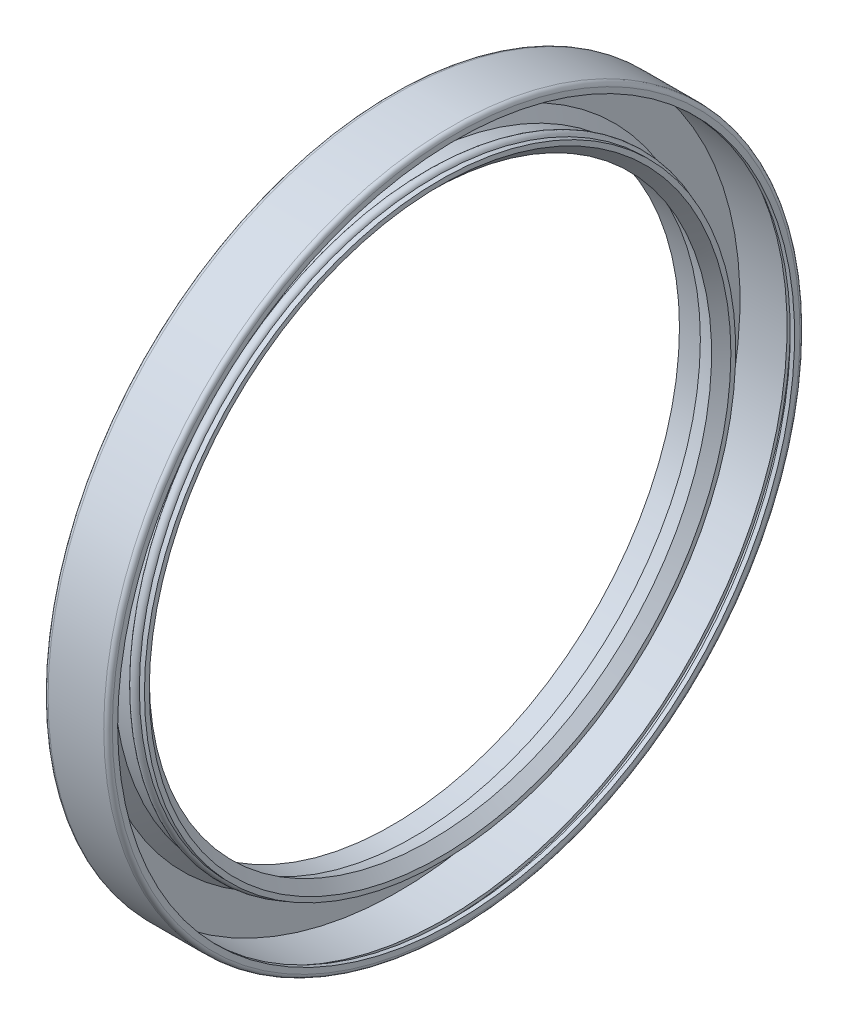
from build123d import *


with BuildPart() as part:
    # Esquisse1 → Base-R_volution (revolve)
    with BuildSketch(Plane(origin=(0, 0, 0), x_dir=(1, 0, 0), z_dir=(0, 1, 0)), mode=Mode.PRIVATE) as base_r_volution_sk:
        with BuildLine():
            Line((0, 53.7), (0, 64.2))
            ThreePointArc((0, 64.2), (0.234314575, 64.765685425), (0.8, 65))
            Line((0.8, 65), (11.2, 65))
            ThreePointArc((11.2, 65), (11.765685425, 64.765685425), (12, 64.2))
            Line((12, 64.2), (12, 63.2))
            Line((12, 63.2), (11.2, 63.2))
            Line((11.2, 63.2), (11.2, 64.4))
            Line((11.2, 64.4), (10, 64.4))
            Line((10, 64.4), (10, 63.8))
            Line((10, 63.8), (1.2, 63.8))
            Line((1.2, 63.8), (1.2, 57.045156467))
            Line((1.2, 57.045156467), (3, 54.9))
            Line((3, 54.9), (6.3, 54.9))
            ThreePointArc((6.3, 54.9), (7.047808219, 55.787038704), (8.048528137, 55.2))
            Line((8.048528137, 55.2), (9, 55.2))
            Line((9, 55.2), (9, 54.3))
            Line((9, 54.3), (7.2, 52.5))
            Line((7.2, 52.5), (3.903027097, 53.7))
            Line((3.903027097, 53.7), (0, 53.7))
        make_face()
    revolve(base_r_volution_sk.sketch.rotate(Axis((0, 0, 0), (1, 0, 0)), 180), axis=Axis((0, 0, 0), (1, 0, 0)))


solid = part.part
